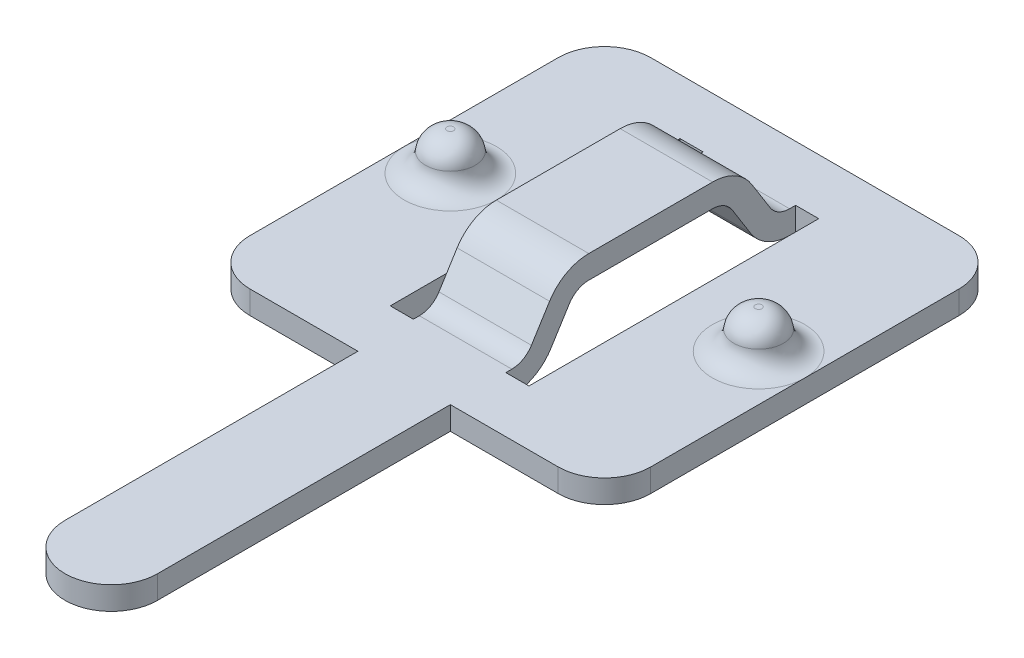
from build123d import *

# Parameters (mm, degrees)
ESQUISSE3_R                = 1.48
ESQUISSE3_W                = 4.5
ESQUISSE3_H                = 9.4
EXTRUSION2_DEPTH           = 0.75
R_P_TITION_LIN_AIRE1_COUNT = 2
R_P_TITION_LIN_AIRE1_PITCH = 10
EXTRUSION3_DEPTH           = 1.5


with BuildPart() as part:
    # Esquisse3 → Extrusion2 (new body)
    with BuildSketch(Plane(origin=(0, 0, 0), x_dir=(1, 0, 0), z_dir=(0, 1, 0))):
        with BuildLine():
            Line((0, 6.5), (10, 6.5))
            ThreePointArc((10, 6.5), (11.060660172, 6.060660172), (11.5, 5))
            Line((11.5, 5), (11.5, -5))
            ThreePointArc((11.5, -5), (11.060660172, -6.060660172), (10, -6.5))
            Line((10, -6.5), (6.5, -6.5))
            Line((6.5, -6.5), (6.5, -16))
            ThreePointArc((6.5, -16), (5, -17.5), (3.5, -16))
            Line((3.5, -16), (3.5, -6.5))
            Line((3.5, -6.5), (0, -6.5))
            ThreePointArc((0, -6.5), (-1.060660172, -6.060660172), (-1.5, -5))
            Line((-1.5, -5), (-1.5, 5))
            ThreePointArc((-1.5, 5), (-1.060660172, 6.060660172), (0, 6.5))
        make_face()
        with Locations(Location((10, 0, 0), (0, 0, 270))):
            Circle(ESQUISSE3_R, mode=Mode.SUBTRACT)
        with Locations(Location((0, 0, 0), (0, 0, 270))):
            Circle(ESQUISSE3_R, mode=Mode.SUBTRACT)
        with Locations((5, 0)):
            Rectangle(ESQUISSE3_W, ESQUISSE3_H, mode=Mode.SUBTRACT)
    extrude(amount=EXTRUSION2_DEPTH)

    # Esquisse1 → R_volution1 (revolve)
    with BuildSketch(Plane.XY, mode=Mode.PRIVATE) as r_volution1_sk:
        with BuildLine():
            Line((0, 2), (0, 0.9))
            ThreePointArc((0, 0.9), (0.128623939, 0.864373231), (0.220588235, 0.767647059))
            ThreePointArc((0.220588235, 0.767647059), (0.753981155, 0.206635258), (1.5, 0))
            Line((1.5, 0), (1.5, 0.75))
            ThreePointArc((1.5, 0.75), (1.032292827, 0.929183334), (0.804029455, 1.375))
            ThreePointArc((0.804029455, 1.375), (0.575766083, 1.820816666), (0.108058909, 2))
            Line((0.108058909, 2), (0, 2))
        make_face()
    r_volution1 = revolve(r_volution1_sk.sketch.rotate(Axis((0, 0, 0), (0, 1, 0)), 90), axis=Axis((0, 0, 0), (0, 1, 0)))

    # R_p_tition lin_aire1: R_volution1 ×2
    with Locations(*[(i * R_P_TITION_LIN_AIRE1_PITCH, 0, 0) for i in range(1, R_P_TITION_LIN_AIRE1_COUNT)]):
        add(r_volution1)

    # Esquisse4 → Extrusion3 (add, symmetric)
    with BuildSketch(Plane(origin=(5, 0, 0), x_dir=(0, 0, -1), z_dir=(1, 0, 0))):
        with BuildLine():
            Line((-2.008797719, 2.75), (2.008797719, 2.75))
            ThreePointArc((2.008797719, 2.75), (2.736012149, 2.561929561), (3.280869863, 2.044878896))
            Line((3.280869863, 2.044878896), (3.869695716, 1.102560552))
            ThreePointArc((3.869695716, 1.102560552), (4.142124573, 0.84403522), (4.505731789, 0.75))
            Line((4.505731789, 0.75), (4.7, 0.75))
            Line((4.7, 0.75), (4.7, 0))
            Line((4.7, 0), (4.505731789, 0))
            ThreePointArc((4.505731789, 0), (3.778517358, 0.188070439), (3.233659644, 0.705121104))
            Line((3.233659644, 0.705121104), (2.644833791, 1.647439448))
            ThreePointArc((2.644833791, 1.647439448), (2.372404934, 1.90596478), (2.008797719, 2))
            Line((2.008797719, 2), (-2.008797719, 2))
            ThreePointArc((-2.008797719, 2), (-2.372404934, 1.90596478), (-2.644833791, 1.647439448))
            Line((-2.644833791, 1.647439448), (-3.233659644, 0.705121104))
            ThreePointArc((-3.233659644, 0.705121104), (-3.778517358, 0.188070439), (-4.505731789, 0))
            Line((-4.505731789, 0), (-4.7, 0))
            Line((-4.7, 0), (-4.7, 0.75))
            Line((-4.7, 0.75), (-4.505731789, 0.75))
            ThreePointArc((-4.505731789, 0.75), (-4.142124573, 0.84403522), (-3.869695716, 1.102560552))
            Line((-3.869695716, 1.102560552), (-3.280869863, 2.044878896))
            ThreePointArc((-3.280869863, 2.044878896), (-2.736012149, 2.561929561), (-2.008797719, 2.75))
        make_face()
    extrude(amount=EXTRUSION3_DEPTH, both=True)


solid = part.part
